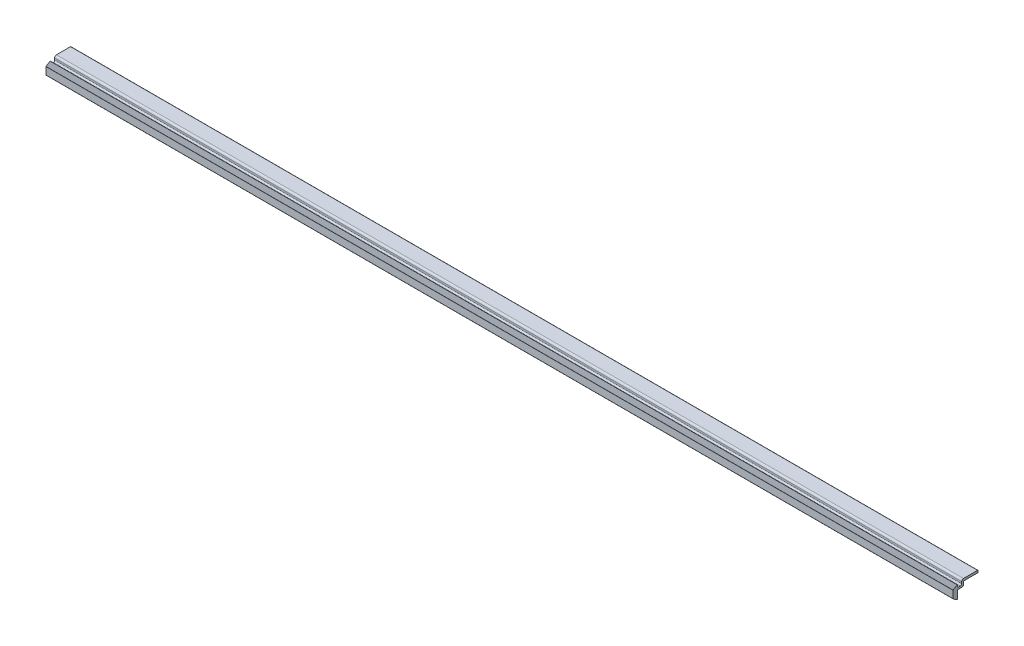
from build123d import *

# Parameters (mm, degrees)
STRUKTURBAUTEIL1_DEPTH = 1000


with BuildPart() as part:
    # Model → Strukturbauteil1 (new body)
    with BuildSketch(Plane(origin=(0, 0, 0), x_dir=(0, -1, 0), z_dir=(1, 0, 0))):
        with BuildLine():
            Line((-4, -5), (4, -5))
            ThreePointArc((4, -5), (4.126912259, -4.971833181), (4.229993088, -4.892621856))
            Line((4.229993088, -4.892621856), (4.52990526, -4.523514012))
            Line((4.52990526, -4.523514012), (4.818714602, -4.145655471))
            Line((4.818714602, -4.145655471), (5.096165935, -3.759380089))
            Line((5.096165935, -3.759380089), (5.362014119, -3.36502916))
            Line((5.362014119, -3.36502916), (5.616024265, -2.96295111))
            Line((5.616024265, -2.96295111), (5.857971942, -2.553501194))
            Line((5.857971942, -2.553501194), (6.08764338, -2.13704118))
            Line((6.08764338, -2.13704118), (6.304835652, -1.71393903))
            Line((6.304835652, -1.71393903), (6.509356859, -1.284568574))
            Line((6.509356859, -1.284568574), (6.701026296, -0.849309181))
            Line((6.701026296, -0.849309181), (6.879674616, -0.408545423))
            ThreePointArc((6.879674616, -0.408545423), (6.847551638, -0.130535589), (6.6, 0))
            Line((6.6, 0), (-1.6, 0))
            ThreePointArc((-1.6, 0), (-1.953553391, 0.146446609), (-2.1, 0.5))
            Line((-2.1, 0.5), (-2.1, 5.7))
            ThreePointArc((-2.1, 5.7), (-2.334314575, 6.265685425), (-2.9, 6.5))
            Line((-2.9, 6.5), (-6.8, 6.5))
            ThreePointArc((-6.8, 6.5), (-7.012132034, 6.587867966), (-7.1, 6.8))
            Line((-7.1, 6.8), (-7.1, 22))
            ThreePointArc((-7.1, 22), (-7.246446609, 22.353553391), (-7.6, 22.5))
            Line((-7.6, 22.5), (-9.1, 22.5))
            ThreePointArc((-9.1, 22.5), (-9.453553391, 22.353553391), (-9.6, 22))
            Line((-9.6, 22), (-9.6, 6.5))
            ThreePointArc((-9.6, 6.5), (-9.014213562, 5.085786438), (-7.6, 4.5))
            Line((-7.6, 4.5), (-5.6, 4.5))
            ThreePointArc((-5.6, 4.5), (-4.539339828, 4.060660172), (-4.1, 3))
            Line((-4.1, 3), (-4.1, 1))
            ThreePointArc((-4.1, 1), (-4.392893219, 0.292893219), (-5.1, 0))
            Line((-5.1, 0), (-6.6, 0))
            ThreePointArc((-6.6, 0), (-6.847551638, -0.130535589), (-6.879674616, -0.408545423))
            Line((-6.879674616, -0.408545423), (-6.701026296, -0.849309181))
            Line((-6.701026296, -0.849309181), (-6.509356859, -1.284568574))
            Line((-6.509356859, -1.284568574), (-6.304835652, -1.71393903))
            Line((-6.304835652, -1.71393903), (-6.08764338, -2.13704118))
            Line((-6.08764338, -2.13704118), (-5.857971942, -2.553501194))
            Line((-5.857971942, -2.553501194), (-5.616024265, -2.96295111))
            Line((-5.616024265, -2.96295111), (-5.362014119, -3.36502916))
            Line((-5.362014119, -3.36502916), (-5.096165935, -3.759380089))
            Line((-5.096165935, -3.759380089), (-4.818714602, -4.145655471))
            Line((-4.818714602, -4.145655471), (-4.52990526, -4.523514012))
            Line((-4.52990526, -4.523514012), (-4.229993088, -4.892621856))
            ThreePointArc((-4.229993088, -4.892621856), (-4.126912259, -4.971833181), (-4, -5))
        make_face()
    extrude(amount=STRUKTURBAUTEIL1_DEPTH)


solid = part.part
